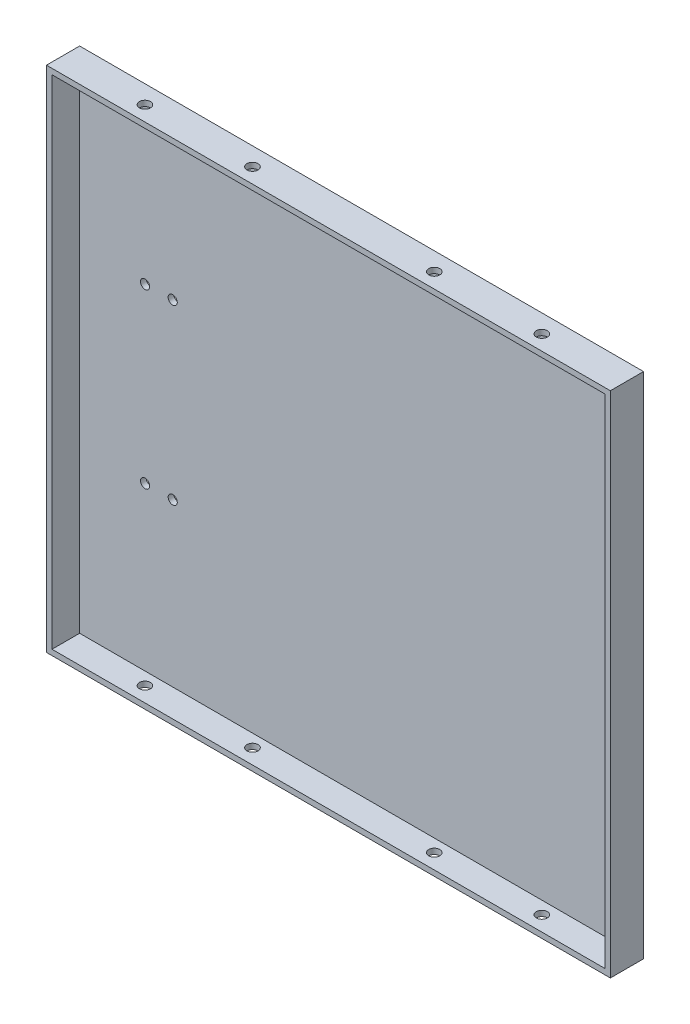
ISO-10303-21;
HEADER;
FILE_DESCRIPTION(('STEP AP214'),'2;1');
FILE_NAME('part.step','',(''),(''),'','','');
FILE_SCHEMA(('AUTOMOTIVE_DESIGN { 1 0 10303 214 1 1 1 1 }'));
ENDSEC;
DATA;
#1=APPLICATION_CONTEXT('core data for automotive mechanical design processes');
#2=APPLICATION_PROTOCOL_DEFINITION('international standard','automotive_design',2000,#1);
#3=PRODUCT_CONTEXT('',#1,'mechanical');
#4=PRODUCT('Part','Part','',(#3));
#5=PRODUCT_RELATED_PRODUCT_CATEGORY('part','',(#4));
#6=PRODUCT_DEFINITION_FORMATION('','',#4);
#7=PRODUCT_DEFINITION_CONTEXT('part definition',#1,'design');
#8=PRODUCT_DEFINITION('design','',#6,#7);
#9=PRODUCT_DEFINITION_SHAPE('','',#8);
#10=(LENGTH_UNIT() NAMED_UNIT(*) SI_UNIT(.MILLI.,.METRE.));
#11=(NAMED_UNIT(*) PLANE_ANGLE_UNIT() SI_UNIT($,.RADIAN.));
#12=(NAMED_UNIT(*) SI_UNIT($,.STERADIAN.) SOLID_ANGLE_UNIT());
#13=UNCERTAINTY_MEASURE_WITH_UNIT(LENGTH_MEASURE(1.E-05),#10,'distance_accuracy_value','');
#14=(GEOMETRIC_REPRESENTATION_CONTEXT(3) GLOBAL_UNCERTAINTY_ASSIGNED_CONTEXT((#13)) GLOBAL_UNIT_ASSIGNED_CONTEXT((#10,
#11,#12)) REPRESENTATION_CONTEXT('',''));
#15=CARTESIAN_POINT('',(0.,0.,0.));
#16=DIRECTION('',(0.,0.,1.));
#17=DIRECTION('',(1.,0.,0.));
#18=AXIS2_PLACEMENT_3D('',#15,#16,#17);
#19=CARTESIAN_POINT('',(102.,92.,12.));
#20=DIRECTION('',(-1.,0.,0.));
#21=DIRECTION('',(0.,-1.,0.));
#22=AXIS2_PLACEMENT_3D('',#19,#20,#21);
#23=PLANE('',#22);
#24=DIRECTION('',(0.,1.,0.));
#25=VECTOR('',#24,1.);
#26=CARTESIAN_POINT('',(102.,92.,0.));
#27=LINE('',#26,#25);
#28=CARTESIAN_POINT('',(102.,-92.,0.));
#29=VERTEX_POINT('',#28);
#30=CARTESIAN_POINT('',(102.,92.,0.));
#31=VERTEX_POINT('',#30);
#32=EDGE_CURVE('E159',#29,#31,#27,.T.);
#33=ORIENTED_EDGE('',*,*,#32,.T.);
#34=DIRECTION('',(0.,0.,-1.));
#35=VECTOR('',#34,1.);
#36=CARTESIAN_POINT('',(102.,92.,12.));
#37=LINE('',#36,#35);
#38=CARTESIAN_POINT('',(102.,92.,12.));
#39=VERTEX_POINT('',#38);
#40=EDGE_CURVE('E11',#39,#31,#37,.T.);
#41=ORIENTED_EDGE('',*,*,#40,.F.);
#42=DIRECTION('',(0.,1.,0.));
#43=VECTOR('',#42,1.);
#44=CARTESIAN_POINT('',(102.,92.,12.));
#45=LINE('',#44,#43);
#46=CARTESIAN_POINT('',(102.,-92.,12.));
#47=VERTEX_POINT('',#46);
#48=EDGE_CURVE('E163',#47,#39,#45,.T.);
#49=ORIENTED_EDGE('',*,*,#48,.F.);
#50=DIRECTION('',(0.,0.,-1.));
#51=VECTOR('',#50,1.);
#52=CARTESIAN_POINT('',(102.,-92.,12.));
#53=LINE('',#52,#51);
#54=EDGE_CURVE('E169',#47,#29,#53,.T.);
#55=ORIENTED_EDGE('',*,*,#54,.T.);
#56=EDGE_LOOP('',(#33,#41,#49,#55));
#57=FACE_BOUND('',#56,.T.);
#58=ADVANCED_FACE('F45',(#57),#23,.F.);
#59=CARTESIAN_POINT('',(-102.,92.,12.));
#60=DIRECTION('',(0.,-1.,0.));
#61=DIRECTION('',(0.,0.,-1.));
#62=AXIS2_PLACEMENT_3D('',#59,#60,#61);
#63=PLANE('',#62);
#64=CARTESIAN_POINT('',(-71.7934583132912,92.,6.5844248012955));
#65=DIRECTION('',(0.,-1.,0.));
#66=DIRECTION('',(0.,0.,-1.));
#67=AXIS2_PLACEMENT_3D('',#64,#65,#66);
#68=CIRCLE('',#67,2.);
#69=CARTESIAN_POINT('',(-71.7934583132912,92.,4.5844248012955));
#70=VERTEX_POINT('',#69);
#71=EDGE_CURVE('E198',#70,#70,#68,.T.);
#72=ORIENTED_EDGE('',*,*,#71,.T.);
#73=EDGE_LOOP('',(#72));
#74=FACE_BOUND('',#73,.T.);
#75=CARTESIAN_POINT('',(-32.8831890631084,92.,6.5844248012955));
#76=DIRECTION('',(0.,-1.,0.));
#77=DIRECTION('',(0.,0.,-1.));
#78=AXIS2_PLACEMENT_3D('',#75,#76,#77);
#79=CIRCLE('',#78,2.);
#80=CARTESIAN_POINT('',(-32.8831890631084,92.,4.5844248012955));
#81=VERTEX_POINT('',#80);
#82=EDGE_CURVE('E227',#81,#81,#79,.T.);
#83=ORIENTED_EDGE('',*,*,#82,.T.);
#84=EDGE_LOOP('',(#83));
#85=FACE_BOUND('',#84,.T.);
#86=CARTESIAN_POINT('',(32.8831890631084,92.,6.5844248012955));
#87=DIRECTION('',(0.,-1.,0.));
#88=DIRECTION('',(0.,0.,1.));
#89=AXIS2_PLACEMENT_3D('',#86,#87,#88);
#90=CIRCLE('',#89,2.);
#91=CARTESIAN_POINT('',(32.8831890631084,92.,8.58442480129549));
#92=VERTEX_POINT('',#91);
#93=EDGE_CURVE('E222',#92,#92,#90,.T.);
#94=ORIENTED_EDGE('',*,*,#93,.T.);
#95=EDGE_LOOP('',(#94));
#96=FACE_BOUND('',#95,.T.);
#97=CARTESIAN_POINT('',(71.7934583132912,92.,6.5844248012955));
#98=DIRECTION('',(0.,-1.,0.));
#99=DIRECTION('',(0.,0.,1.));
#100=AXIS2_PLACEMENT_3D('',#97,#98,#99);
#101=CIRCLE('',#100,2.);
#102=CARTESIAN_POINT('',(71.7934583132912,92.,8.58442480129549));
#103=VERTEX_POINT('',#102);
#104=EDGE_CURVE('E218',#103,#103,#101,.T.);
#105=ORIENTED_EDGE('',*,*,#104,.T.);
#106=EDGE_LOOP('',(#105));
#107=FACE_BOUND('',#106,.T.);
#108=DIRECTION('',(-1.,0.,0.));
#109=VECTOR('',#108,1.);
#110=CARTESIAN_POINT('',(-102.,92.,0.));
#111=LINE('',#110,#109);
#112=CARTESIAN_POINT('',(-102.,92.,0.));
#113=VERTEX_POINT('',#112);
#114=EDGE_CURVE('E172',#31,#113,#111,.T.);
#115=ORIENTED_EDGE('',*,*,#114,.T.);
#116=DIRECTION('',(0.,0.,-1.));
#117=VECTOR('',#116,1.);
#118=CARTESIAN_POINT('',(-102.,92.,12.));
#119=LINE('',#118,#117);
#120=CARTESIAN_POINT('',(-102.,92.,12.));
#121=VERTEX_POINT('',#120);
#122=EDGE_CURVE('E53',#121,#113,#119,.T.);
#123=ORIENTED_EDGE('',*,*,#122,.F.);
#124=DIRECTION('',(-1.,0.,0.));
#125=VECTOR('',#124,1.);
#126=CARTESIAN_POINT('',(-102.,92.,12.));
#127=LINE('',#126,#125);
#128=EDGE_CURVE('E98',#39,#121,#127,.T.);
#129=ORIENTED_EDGE('',*,*,#128,.F.);
#130=ORIENTED_EDGE('',*,*,#40,.T.);
#131=EDGE_LOOP('',(#115,#123,#129,#130));
#132=FACE_BOUND('',#131,.T.);
#133=ADVANCED_FACE('F260',(#74,#85,#96,#107,#132),#63,.F.);
#134=CARTESIAN_POINT('',(-102.,92.,12.));
#135=DIRECTION('',(1.,0.,0.));
#136=DIRECTION('',(0.,1.,0.));
#137=AXIS2_PLACEMENT_3D('',#134,#135,#136);
#138=PLANE('',#137);
#139=DIRECTION('',(0.,-1.,0.));
#140=VECTOR('',#139,1.);
#141=CARTESIAN_POINT('',(-102.,92.,0.));
#142=LINE('',#141,#140);
#143=CARTESIAN_POINT('',(-102.,-92.,0.));
#144=VERTEX_POINT('',#143);
#145=EDGE_CURVE('E174',#113,#144,#142,.T.);
#146=ORIENTED_EDGE('',*,*,#145,.T.);
#147=DIRECTION('',(0.,0.,-1.));
#148=VECTOR('',#147,1.);
#149=CARTESIAN_POINT('',(-102.,-92.,12.));
#150=LINE('',#149,#148);
#151=CARTESIAN_POINT('',(-102.,-92.,12.));
#152=VERTEX_POINT('',#151);
#153=EDGE_CURVE('E178',#152,#144,#150,.T.);
#154=ORIENTED_EDGE('',*,*,#153,.F.);
#155=DIRECTION('',(0.,-1.,0.));
#156=VECTOR('',#155,1.);
#157=CARTESIAN_POINT('',(-102.,92.,12.));
#158=LINE('',#157,#156);
#159=EDGE_CURVE('E166',#121,#152,#158,.T.);
#160=ORIENTED_EDGE('',*,*,#159,.F.);
#161=ORIENTED_EDGE('',*,*,#122,.T.);
#162=EDGE_LOOP('',(#146,#154,#160,#161));
#163=FACE_BOUND('',#162,.T.);
#164=ADVANCED_FACE('F248',(#163),#138,.F.);
#165=CARTESIAN_POINT('',(-102.,-92.,12.));
#166=DIRECTION('',(0.,1.,0.));
#167=DIRECTION('',(0.,0.,1.));
#168=AXIS2_PLACEMENT_3D('',#165,#166,#167);
#169=PLANE('',#168);
#170=CARTESIAN_POINT('',(-71.7934583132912,-92.,6.5844248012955));
#171=DIRECTION('',(0.,-1.,0.));
#172=DIRECTION('',(0.,0.,-1.));
#173=AXIS2_PLACEMENT_3D('',#170,#171,#172);
#174=CIRCLE('',#173,2.);
#175=CARTESIAN_POINT('',(-71.7934583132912,-92.,4.5844248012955));
#176=VERTEX_POINT('',#175);
#177=EDGE_CURVE('E186',#176,#176,#174,.T.);
#178=ORIENTED_EDGE('',*,*,#177,.F.);
#179=EDGE_LOOP('',(#178));
#180=FACE_BOUND('',#179,.T.);
#181=CARTESIAN_POINT('',(-32.8831890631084,-92.,6.5844248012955));
#182=DIRECTION('',(0.,-1.,0.));
#183=DIRECTION('',(0.,0.,-1.));
#184=AXIS2_PLACEMENT_3D('',#181,#182,#183);
#185=CIRCLE('',#184,2.);
#186=CARTESIAN_POINT('',(-32.8831890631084,-92.,4.5844248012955));
#187=VERTEX_POINT('',#186);
#188=EDGE_CURVE('E233',#187,#187,#185,.T.);
#189=ORIENTED_EDGE('',*,*,#188,.F.);
#190=EDGE_LOOP('',(#189));
#191=FACE_BOUND('',#190,.T.);
#192=CARTESIAN_POINT('',(32.8831890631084,-92.,6.5844248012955));
#193=DIRECTION('',(0.,-1.,0.));
#194=DIRECTION('',(0.,0.,1.));
#195=AXIS2_PLACEMENT_3D('',#192,#193,#194);
#196=CIRCLE('',#195,2.);
#197=CARTESIAN_POINT('',(32.8831890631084,-92.,8.58442480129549));
#198=VERTEX_POINT('',#197);
#199=EDGE_CURVE('E235',#198,#198,#196,.T.);
#200=ORIENTED_EDGE('',*,*,#199,.F.);
#201=EDGE_LOOP('',(#200));
#202=FACE_BOUND('',#201,.T.);
#203=CARTESIAN_POINT('',(71.7934583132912,-92.,6.5844248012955));
#204=DIRECTION('',(0.,-1.,0.));
#205=DIRECTION('',(0.,0.,1.));
#206=AXIS2_PLACEMENT_3D('',#203,#204,#205);
#207=CIRCLE('',#206,2.);
#208=CARTESIAN_POINT('',(71.7934583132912,-92.,8.58442480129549));
#209=VERTEX_POINT('',#208);
#210=EDGE_CURVE('E146',#209,#209,#207,.T.);
#211=ORIENTED_EDGE('',*,*,#210,.F.);
#212=EDGE_LOOP('',(#211));
#213=FACE_BOUND('',#212,.T.);
#214=DIRECTION('',(1.,0.,0.));
#215=VECTOR('',#214,1.);
#216=CARTESIAN_POINT('',(-102.,-92.,0.));
#217=LINE('',#216,#215);
#218=EDGE_CURVE('E91',#144,#29,#217,.T.);
#219=ORIENTED_EDGE('',*,*,#218,.T.);
#220=ORIENTED_EDGE('',*,*,#54,.F.);
#221=DIRECTION('',(1.,0.,0.));
#222=VECTOR('',#221,1.);
#223=CARTESIAN_POINT('',(-102.,-92.,12.));
#224=LINE('',#223,#222);
#225=EDGE_CURVE('E70',#152,#47,#224,.T.);
#226=ORIENTED_EDGE('',*,*,#225,.F.);
#227=ORIENTED_EDGE('',*,*,#153,.T.);
#228=EDGE_LOOP('',(#219,#220,#226,#227));
#229=FACE_BOUND('',#228,.T.);
#230=ADVANCED_FACE('F245',(#180,#191,#202,#213,#229),#169,.F.);
#231=CARTESIAN_POINT('',(0.,0.,12.));
#232=DIRECTION('',(0.,0.,1.));
#233=DIRECTION('',(1.,0.,0.));
#234=AXIS2_PLACEMENT_3D('',#231,#232,#233);
#235=PLANE('',#234);
#236=DIRECTION('',(1.,0.,0.));
#237=VECTOR('',#236,1.);
#238=CARTESIAN_POINT('',(-100.,-90.,12.));
#239=LINE('',#238,#237);
#240=CARTESIAN_POINT('',(-100.,-90.,12.));
#241=VERTEX_POINT('',#240);
#242=CARTESIAN_POINT('',(100.,-90.,12.));
#243=VERTEX_POINT('',#242);
#244=EDGE_CURVE('E61',#241,#243,#239,.T.);
#245=ORIENTED_EDGE('',*,*,#244,.F.);
#246=DIRECTION('',(0.,-1.,0.));
#247=VECTOR('',#246,1.);
#248=CARTESIAN_POINT('',(-100.,90.,12.));
#249=LINE('',#248,#247);
#250=CARTESIAN_POINT('',(-100.,90.,12.));
#251=VERTEX_POINT('',#250);
#252=EDGE_CURVE('E140',#251,#241,#249,.T.);
#253=ORIENTED_EDGE('',*,*,#252,.F.);
#254=DIRECTION('',(1.,0.,0.));
#255=VECTOR('',#254,1.);
#256=CARTESIAN_POINT('',(-100.,90.,12.));
#257=LINE('',#256,#255);
#258=CARTESIAN_POINT('',(100.,90.,12.));
#259=VERTEX_POINT('',#258);
#260=EDGE_CURVE('E143',#251,#259,#257,.T.);
#261=ORIENTED_EDGE('',*,*,#260,.T.);
#262=DIRECTION('',(0.,-1.,0.));
#263=VECTOR('',#262,1.);
#264=CARTESIAN_POINT('',(100.,90.,12.));
#265=LINE('',#264,#263);
#266=EDGE_CURVE('E152',#259,#243,#265,.T.);
#267=ORIENTED_EDGE('',*,*,#266,.T.);
#268=EDGE_LOOP('',(#245,#253,#261,#267));
#269=FACE_BOUND('',#268,.T.);
#270=ORIENTED_EDGE('',*,*,#48,.T.);
#271=ORIENTED_EDGE('',*,*,#128,.T.);
#272=ORIENTED_EDGE('',*,*,#159,.T.);
#273=ORIENTED_EDGE('',*,*,#225,.T.);
#274=EDGE_LOOP('',(#270,#271,#272,#273));
#275=FACE_BOUND('',#274,.T.);
#276=ADVANCED_FACE('F247',(#269,#275),#235,.T.);
#277=CARTESIAN_POINT('',(0.,0.,0.));
#278=DIRECTION('',(0.,0.,1.));
#279=DIRECTION('',(1.,0.,0.));
#280=AXIS2_PLACEMENT_3D('',#277,#278,#279);
#281=PLANE('',#280);
#282=CARTESIAN_POINT('',(-66.3286348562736,-31.2999950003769,0.));
#283=DIRECTION('',(0.,0.,-1.));
#284=DIRECTION('',(-1.,0.,0.));
#285=AXIS2_PLACEMENT_3D('',#282,#283,#284);
#286=CIRCLE('',#285,1.65);
#287=CARTESIAN_POINT('',(-67.9786348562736,-31.2999950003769,0.));
#288=VERTEX_POINT('',#287);
#289=EDGE_CURVE('E358',#288,#288,#286,.T.);
#290=ORIENTED_EDGE('',*,*,#289,.F.);
#291=EDGE_LOOP('',(#290));
#292=FACE_BOUND('',#291,.T.);
#293=CARTESIAN_POINT('',(-76.328134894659,31.1999999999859,0.));
#294=DIRECTION('',(0.,0.,-1.));
#295=DIRECTION('',(-1.,0.,0.));
#296=AXIS2_PLACEMENT_3D('',#293,#294,#295);
#297=CIRCLE('',#296,1.64999999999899);
#298=CARTESIAN_POINT('',(-77.978134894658,31.1999999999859,0.));
#299=VERTEX_POINT('',#298);
#300=EDGE_CURVE('E355',#299,#299,#297,.T.);
#301=ORIENTED_EDGE('',*,*,#300,.F.);
#302=EDGE_LOOP('',(#301));
#303=FACE_BOUND('',#302,.T.);
#304=CARTESIAN_POINT('',(-66.3286348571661,31.2999950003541,0.));
#305=DIRECTION('',(0.,0.,-1.));
#306=DIRECTION('',(-1.,0.,0.));
#307=AXIS2_PLACEMENT_3D('',#304,#305,#306);
#308=CIRCLE('',#307,1.64999999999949);
#309=CARTESIAN_POINT('',(-67.9786348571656,31.2999950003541,0.));
#310=VERTEX_POINT('',#309);
#311=EDGE_CURVE('E348',#310,#310,#308,.T.);
#312=ORIENTED_EDGE('',*,*,#311,.F.);
#313=EDGE_LOOP('',(#312));
#314=FACE_BOUND('',#313,.T.);
#315=CARTESIAN_POINT('',(-76.3281348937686,-31.2000000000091,0.));
#316=DIRECTION('',(0.,0.,-1.));
#317=DIRECTION('',(-1.,0.,0.));
#318=AXIS2_PLACEMENT_3D('',#315,#316,#317);
#319=CIRCLE('',#318,1.65);
#320=CARTESIAN_POINT('',(-77.9781348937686,-31.2000000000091,0.));
#321=VERTEX_POINT('',#320);
#322=EDGE_CURVE('E211',#321,#321,#319,.T.);
#323=ORIENTED_EDGE('',*,*,#322,.F.);
#324=EDGE_LOOP('',(#323));
#325=FACE_BOUND('',#324,.T.);
#326=ORIENTED_EDGE('',*,*,#32,.F.);
#327=ORIENTED_EDGE('',*,*,#218,.F.);
#328=ORIENTED_EDGE('',*,*,#145,.F.);
#329=ORIENTED_EDGE('',*,*,#114,.F.);
#330=EDGE_LOOP('',(#326,#327,#328,#329));
#331=FACE_BOUND('',#330,.T.);
#332=ADVANCED_FACE('F256',(#292,#303,#314,#325,#331),#281,.F.);
#333=CARTESIAN_POINT('',(-100.,-90.,2.));
#334=DIRECTION('',(0.,-1.,0.));
#335=DIRECTION('',(0.,0.,-1.));
#336=AXIS2_PLACEMENT_3D('',#333,#334,#335);
#337=PLANE('',#336);
#338=CARTESIAN_POINT('',(-71.7934583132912,-90.,6.5844248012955));
#339=DIRECTION('',(0.,-1.,0.));
#340=DIRECTION('',(0.,0.,-1.));
#341=AXIS2_PLACEMENT_3D('',#338,#339,#340);
#342=CIRCLE('',#341,2.);
#343=CARTESIAN_POINT('',(-71.7934583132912,-90.,4.5844248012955));
#344=VERTEX_POINT('',#343);
#345=EDGE_CURVE('E153',#344,#344,#342,.T.);
#346=ORIENTED_EDGE('',*,*,#345,.T.);
#347=EDGE_LOOP('',(#346));
#348=FACE_BOUND('',#347,.T.);
#349=CARTESIAN_POINT('',(-32.8831890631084,-90.,6.5844248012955));
#350=DIRECTION('',(0.,-1.,0.));
#351=DIRECTION('',(0.,0.,-1.));
#352=AXIS2_PLACEMENT_3D('',#349,#350,#351);
#353=CIRCLE('',#352,2.);
#354=CARTESIAN_POINT('',(-32.8831890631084,-90.,4.5844248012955));
#355=VERTEX_POINT('',#354);
#356=EDGE_CURVE('E189',#355,#355,#353,.T.);
#357=ORIENTED_EDGE('',*,*,#356,.T.);
#358=EDGE_LOOP('',(#357));
#359=FACE_BOUND('',#358,.T.);
#360=CARTESIAN_POINT('',(32.8831890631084,-90.,6.5844248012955));
#361=DIRECTION('',(0.,-1.,0.));
#362=DIRECTION('',(0.,0.,-1.));
#363=AXIS2_PLACEMENT_3D('',#360,#361,#362);
#364=CIRCLE('',#363,2.);
#365=CARTESIAN_POINT('',(32.8831890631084,-90.,4.5844248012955));
#366=VERTEX_POINT('',#365);
#367=EDGE_CURVE('E185',#366,#366,#364,.T.);
#368=ORIENTED_EDGE('',*,*,#367,.T.);
#369=EDGE_LOOP('',(#368));
#370=FACE_BOUND('',#369,.T.);
#371=CARTESIAN_POINT('',(71.7934583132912,-90.,6.5844248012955));
#372=DIRECTION('',(0.,-1.,0.));
#373=DIRECTION('',(0.,0.,-1.));
#374=AXIS2_PLACEMENT_3D('',#371,#372,#373);
#375=CIRCLE('',#374,2.);
#376=CARTESIAN_POINT('',(71.7934583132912,-90.,4.5844248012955));
#377=VERTEX_POINT('',#376);
#378=EDGE_CURVE('E182',#377,#377,#375,.T.);
#379=ORIENTED_EDGE('',*,*,#378,.T.);
#380=EDGE_LOOP('',(#379));
#381=FACE_BOUND('',#380,.T.);
#382=ORIENTED_EDGE('',*,*,#244,.T.);
#383=DIRECTION('',(0.,0.,1.));
#384=VECTOR('',#383,1.);
#385=CARTESIAN_POINT('',(100.,-90.,2.));
#386=LINE('',#385,#384);
#387=CARTESIAN_POINT('',(100.,-90.,2.));
#388=VERTEX_POINT('',#387);
#389=EDGE_CURVE('E124',#388,#243,#386,.T.);
#390=ORIENTED_EDGE('',*,*,#389,.F.);
#391=DIRECTION('',(1.,0.,0.));
#392=VECTOR('',#391,1.);
#393=CARTESIAN_POINT('',(-100.,-90.,2.));
#394=LINE('',#393,#392);
#395=CARTESIAN_POINT('',(-100.,-90.,2.));
#396=VERTEX_POINT('',#395);
#397=EDGE_CURVE('E131',#396,#388,#394,.T.);
#398=ORIENTED_EDGE('',*,*,#397,.F.);
#399=DIRECTION('',(0.,0.,1.));
#400=VECTOR('',#399,1.);
#401=CARTESIAN_POINT('',(-100.,-90.,2.));
#402=LINE('',#401,#400);
#403=EDGE_CURVE('E157',#396,#241,#402,.T.);
#404=ORIENTED_EDGE('',*,*,#403,.T.);
#405=EDGE_LOOP('',(#382,#390,#398,#404));
#406=FACE_BOUND('',#405,.T.);
#407=ADVANCED_FACE('F134',(#348,#359,#370,#381,#406),#337,.F.);
#408=CARTESIAN_POINT('',(-100.,90.,2.));
#409=DIRECTION('',(-1.,0.,0.));
#410=DIRECTION('',(0.,-1.,0.));
#411=AXIS2_PLACEMENT_3D('',#408,#409,#410);
#412=PLANE('',#411);
#413=ORIENTED_EDGE('',*,*,#252,.T.);
#414=ORIENTED_EDGE('',*,*,#403,.F.);
#415=DIRECTION('',(0.,-1.,0.));
#416=VECTOR('',#415,1.);
#417=CARTESIAN_POINT('',(-100.,90.,2.));
#418=LINE('',#417,#416);
#419=CARTESIAN_POINT('',(-100.,90.,2.));
#420=VERTEX_POINT('',#419);
#421=EDGE_CURVE('E136',#420,#396,#418,.T.);
#422=ORIENTED_EDGE('',*,*,#421,.F.);
#423=DIRECTION('',(0.,0.,1.));
#424=VECTOR('',#423,1.);
#425=CARTESIAN_POINT('',(-100.,90.,2.));
#426=LINE('',#425,#424);
#427=EDGE_CURVE('E160',#420,#251,#426,.T.);
#428=ORIENTED_EDGE('',*,*,#427,.T.);
#429=EDGE_LOOP('',(#413,#414,#422,#428));
#430=FACE_BOUND('',#429,.T.);
#431=ADVANCED_FACE('F285',(#430),#412,.F.);
#432=CARTESIAN_POINT('',(-100.,90.,2.));
#433=DIRECTION('',(0.,-1.,0.));
#434=DIRECTION('',(0.,0.,-1.));
#435=AXIS2_PLACEMENT_3D('',#432,#433,#434);
#436=PLANE('',#435);
#437=CARTESIAN_POINT('',(-71.7934583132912,90.,6.5844248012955));
#438=DIRECTION('',(0.,-1.,0.));
#439=DIRECTION('',(0.,0.,-1.));
#440=AXIS2_PLACEMENT_3D('',#437,#438,#439);
#441=CIRCLE('',#440,2.);
#442=CARTESIAN_POINT('',(-71.7934583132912,90.,4.5844248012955));
#443=VERTEX_POINT('',#442);
#444=EDGE_CURVE('E204',#443,#443,#441,.F.);
#445=ORIENTED_EDGE('',*,*,#444,.T.);
#446=EDGE_LOOP('',(#445));
#447=FACE_BOUND('',#446,.T.);
#448=CARTESIAN_POINT('',(-32.8831890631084,90.,6.5844248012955));
#449=DIRECTION('',(0.,-1.,0.));
#450=DIRECTION('',(0.,0.,-1.));
#451=AXIS2_PLACEMENT_3D('',#448,#449,#450);
#452=CIRCLE('',#451,2.);
#453=CARTESIAN_POINT('',(-32.8831890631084,90.,4.5844248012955));
#454=VERTEX_POINT('',#453);
#455=EDGE_CURVE('E201',#454,#454,#452,.F.);
#456=ORIENTED_EDGE('',*,*,#455,.T.);
#457=EDGE_LOOP('',(#456));
#458=FACE_BOUND('',#457,.T.);
#459=CARTESIAN_POINT('',(32.8831890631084,90.,6.5844248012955));
#460=DIRECTION('',(0.,-1.,0.));
#461=DIRECTION('',(0.,0.,-1.));
#462=AXIS2_PLACEMENT_3D('',#459,#460,#461);
#463=CIRCLE('',#462,2.);
#464=CARTESIAN_POINT('',(32.8831890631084,90.,4.5844248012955));
#465=VERTEX_POINT('',#464);
#466=EDGE_CURVE('E197',#465,#465,#463,.F.);
#467=ORIENTED_EDGE('',*,*,#466,.T.);
#468=EDGE_LOOP('',(#467));
#469=FACE_BOUND('',#468,.T.);
#470=CARTESIAN_POINT('',(71.7934583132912,90.,6.5844248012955));
#471=DIRECTION('',(0.,-1.,0.));
#472=DIRECTION('',(0.,0.,-1.));
#473=AXIS2_PLACEMENT_3D('',#470,#471,#472);
#474=CIRCLE('',#473,2.);
#475=CARTESIAN_POINT('',(71.7934583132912,90.,4.5844248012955));
#476=VERTEX_POINT('',#475);
#477=EDGE_CURVE('E194',#476,#476,#474,.F.);
#478=ORIENTED_EDGE('',*,*,#477,.T.);
#479=EDGE_LOOP('',(#478));
#480=FACE_BOUND('',#479,.T.);
#481=ORIENTED_EDGE('',*,*,#260,.F.);
#482=ORIENTED_EDGE('',*,*,#427,.F.);
#483=DIRECTION('',(1.,0.,0.));
#484=VECTOR('',#483,1.);
#485=CARTESIAN_POINT('',(-100.,90.,2.));
#486=LINE('',#485,#484);
#487=CARTESIAN_POINT('',(100.,90.,2.));
#488=VERTEX_POINT('',#487);
#489=EDGE_CURVE('E130',#420,#488,#486,.T.);
#490=ORIENTED_EDGE('',*,*,#489,.T.);
#491=DIRECTION('',(0.,0.,1.));
#492=VECTOR('',#491,1.);
#493=CARTESIAN_POINT('',(100.,90.,2.));
#494=LINE('',#493,#492);
#495=EDGE_CURVE('E126',#488,#259,#494,.T.);
#496=ORIENTED_EDGE('',*,*,#495,.T.);
#497=EDGE_LOOP('',(#481,#482,#490,#496));
#498=FACE_BOUND('',#497,.T.);
#499=ADVANCED_FACE('F292',(#447,#458,#469,#480,#498),#436,.T.);
#500=CARTESIAN_POINT('',(100.,90.,2.));
#501=DIRECTION('',(-1.,0.,0.));
#502=DIRECTION('',(0.,-1.,0.));
#503=AXIS2_PLACEMENT_3D('',#500,#501,#502);
#504=PLANE('',#503);
#505=ORIENTED_EDGE('',*,*,#266,.F.);
#506=ORIENTED_EDGE('',*,*,#495,.F.);
#507=DIRECTION('',(0.,-1.,0.));
#508=VECTOR('',#507,1.);
#509=CARTESIAN_POINT('',(100.,90.,2.));
#510=LINE('',#509,#508);
#511=EDGE_CURVE('E121',#488,#388,#510,.T.);
#512=ORIENTED_EDGE('',*,*,#511,.T.);
#513=ORIENTED_EDGE('',*,*,#389,.T.);
#514=EDGE_LOOP('',(#505,#506,#512,#513));
#515=FACE_BOUND('',#514,.T.);
#516=ADVANCED_FACE('F123',(#515),#504,.T.);
#517=CARTESIAN_POINT('',(0.,0.,2.));
#518=DIRECTION('',(0.,0.,-1.));
#519=DIRECTION('',(-1.,0.,0.));
#520=AXIS2_PLACEMENT_3D('',#517,#518,#519);
#521=PLANE('',#520);
#522=CARTESIAN_POINT('',(-66.3286348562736,-31.2999950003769,2.));
#523=DIRECTION('',(0.,0.,-1.));
#524=DIRECTION('',(-1.,0.,0.));
#525=AXIS2_PLACEMENT_3D('',#522,#523,#524);
#526=CIRCLE('',#525,1.65);
#527=CARTESIAN_POINT('',(-67.9786348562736,-31.2999950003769,2.));
#528=VERTEX_POINT('',#527);
#529=EDGE_CURVE('E48',#528,#528,#526,.T.);
#530=ORIENTED_EDGE('',*,*,#529,.T.);
#531=EDGE_LOOP('',(#530));
#532=FACE_BOUND('',#531,.T.);
#533=CARTESIAN_POINT('',(-76.328134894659,31.1999999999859,2.));
#534=DIRECTION('',(0.,0.,-1.));
#535=DIRECTION('',(-1.,0.,0.));
#536=AXIS2_PLACEMENT_3D('',#533,#534,#535);
#537=CIRCLE('',#536,1.64999999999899);
#538=CARTESIAN_POINT('',(-77.978134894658,31.1999999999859,2.));
#539=VERTEX_POINT('',#538);
#540=EDGE_CURVE('E213',#539,#539,#537,.T.);
#541=ORIENTED_EDGE('',*,*,#540,.T.);
#542=EDGE_LOOP('',(#541));
#543=FACE_BOUND('',#542,.T.);
#544=CARTESIAN_POINT('',(-66.3286348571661,31.2999950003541,2.));
#545=DIRECTION('',(0.,0.,-1.));
#546=DIRECTION('',(-1.,0.,0.));
#547=AXIS2_PLACEMENT_3D('',#544,#545,#546);
#548=CIRCLE('',#547,1.64999999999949);
#549=CARTESIAN_POINT('',(-67.9786348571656,31.2999950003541,2.));
#550=VERTEX_POINT('',#549);
#551=EDGE_CURVE('E210',#550,#550,#548,.T.);
#552=ORIENTED_EDGE('',*,*,#551,.T.);
#553=EDGE_LOOP('',(#552));
#554=FACE_BOUND('',#553,.T.);
#555=CARTESIAN_POINT('',(-76.3281348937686,-31.2000000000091,2.));
#556=DIRECTION('',(0.,0.,-1.));
#557=DIRECTION('',(-1.,0.,0.));
#558=AXIS2_PLACEMENT_3D('',#555,#556,#557);
#559=CIRCLE('',#558,1.65);
#560=CARTESIAN_POINT('',(-77.9781348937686,-31.2000000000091,2.));
#561=VERTEX_POINT('',#560);
#562=EDGE_CURVE('E207',#561,#561,#559,.T.);
#563=ORIENTED_EDGE('',*,*,#562,.T.);
#564=EDGE_LOOP('',(#563));
#565=FACE_BOUND('',#564,.T.);
#566=ORIENTED_EDGE('',*,*,#397,.T.);
#567=ORIENTED_EDGE('',*,*,#511,.F.);
#568=ORIENTED_EDGE('',*,*,#489,.F.);
#569=ORIENTED_EDGE('',*,*,#421,.T.);
#570=EDGE_LOOP('',(#566,#567,#568,#569));
#571=FACE_BOUND('',#570,.T.);
#572=ADVANCED_FACE('F138',(#532,#543,#554,#565,#571),#521,.F.);
#573=CARTESIAN_POINT('',(71.7934583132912,-82.,6.5844248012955));
#574=DIRECTION('',(0.,-1.,0.));
#575=DIRECTION('',(0.,0.,-1.));
#576=AXIS2_PLACEMENT_3D('',#573,#574,#575);
#577=CYLINDRICAL_SURFACE('',#576,2.);
#578=ORIENTED_EDGE('',*,*,#210,.T.);
#579=EDGE_LOOP('',(#578));
#580=FACE_BOUND('',#579,.T.);
#581=ORIENTED_EDGE('',*,*,#378,.F.);
#582=EDGE_LOOP('',(#581));
#583=FACE_BOUND('',#582,.T.);
#584=ADVANCED_FACE('F242',(#580,#583),#577,.F.);
#585=CARTESIAN_POINT('',(32.8831890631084,-82.,6.5844248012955));
#586=DIRECTION('',(0.,-1.,0.));
#587=DIRECTION('',(0.,0.,-1.));
#588=AXIS2_PLACEMENT_3D('',#585,#586,#587);
#589=CYLINDRICAL_SURFACE('',#588,2.);
#590=ORIENTED_EDGE('',*,*,#199,.T.);
#591=EDGE_LOOP('',(#590));
#592=FACE_BOUND('',#591,.T.);
#593=ORIENTED_EDGE('',*,*,#367,.F.);
#594=EDGE_LOOP('',(#593));
#595=FACE_BOUND('',#594,.T.);
#596=ADVANCED_FACE('F302',(#592,#595),#589,.F.);
#597=CARTESIAN_POINT('',(-32.8831890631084,-82.,6.5844248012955));
#598=DIRECTION('',(0.,-1.,0.));
#599=DIRECTION('',(0.,0.,-1.));
#600=AXIS2_PLACEMENT_3D('',#597,#598,#599);
#601=CYLINDRICAL_SURFACE('',#600,2.);
#602=ORIENTED_EDGE('',*,*,#188,.T.);
#603=EDGE_LOOP('',(#602));
#604=FACE_BOUND('',#603,.T.);
#605=ORIENTED_EDGE('',*,*,#356,.F.);
#606=EDGE_LOOP('',(#605));
#607=FACE_BOUND('',#606,.T.);
#608=ADVANCED_FACE('F305',(#604,#607),#601,.F.);
#609=CARTESIAN_POINT('',(-71.7934583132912,-82.,6.5844248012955));
#610=DIRECTION('',(0.,-1.,0.));
#611=DIRECTION('',(0.,0.,-1.));
#612=AXIS2_PLACEMENT_3D('',#609,#610,#611);
#613=CYLINDRICAL_SURFACE('',#612,2.);
#614=ORIENTED_EDGE('',*,*,#177,.T.);
#615=EDGE_LOOP('',(#614));
#616=FACE_BOUND('',#615,.T.);
#617=ORIENTED_EDGE('',*,*,#345,.F.);
#618=EDGE_LOOP('',(#617));
#619=FACE_BOUND('',#618,.T.);
#620=ADVANCED_FACE('F308',(#616,#619),#613,.F.);
#621=CARTESIAN_POINT('',(71.7934583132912,82.,6.5844248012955));
#622=DIRECTION('',(0.,1.,0.));
#623=DIRECTION('',(0.,0.,1.));
#624=AXIS2_PLACEMENT_3D('',#621,#622,#623);
#625=CYLINDRICAL_SURFACE('',#624,2.);
#626=ORIENTED_EDGE('',*,*,#477,.F.);
#627=EDGE_LOOP('',(#626));
#628=FACE_BOUND('',#627,.T.);
#629=ORIENTED_EDGE('',*,*,#104,.F.);
#630=EDGE_LOOP('',(#629));
#631=FACE_BOUND('',#630,.T.);
#632=ADVANCED_FACE('F312',(#628,#631),#625,.F.);
#633=CARTESIAN_POINT('',(32.8831890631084,82.,6.5844248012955));
#634=DIRECTION('',(0.,1.,0.));
#635=DIRECTION('',(0.,0.,1.));
#636=AXIS2_PLACEMENT_3D('',#633,#634,#635);
#637=CYLINDRICAL_SURFACE('',#636,2.);
#638=ORIENTED_EDGE('',*,*,#466,.F.);
#639=EDGE_LOOP('',(#638));
#640=FACE_BOUND('',#639,.T.);
#641=ORIENTED_EDGE('',*,*,#93,.F.);
#642=EDGE_LOOP('',(#641));
#643=FACE_BOUND('',#642,.T.);
#644=ADVANCED_FACE('F316',(#640,#643),#637,.F.);
#645=CARTESIAN_POINT('',(-32.8831890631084,82.,6.5844248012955));
#646=DIRECTION('',(0.,1.,0.));
#647=DIRECTION('',(0.,0.,1.));
#648=AXIS2_PLACEMENT_3D('',#645,#646,#647);
#649=CYLINDRICAL_SURFACE('',#648,2.);
#650=ORIENTED_EDGE('',*,*,#455,.F.);
#651=EDGE_LOOP('',(#650));
#652=FACE_BOUND('',#651,.T.);
#653=ORIENTED_EDGE('',*,*,#82,.F.);
#654=EDGE_LOOP('',(#653));
#655=FACE_BOUND('',#654,.T.);
#656=ADVANCED_FACE('F320',(#652,#655),#649,.F.);
#657=CARTESIAN_POINT('',(-71.7934583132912,82.,6.5844248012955));
#658=DIRECTION('',(0.,1.,0.));
#659=DIRECTION('',(0.,0.,1.));
#660=AXIS2_PLACEMENT_3D('',#657,#658,#659);
#661=CYLINDRICAL_SURFACE('',#660,2.);
#662=ORIENTED_EDGE('',*,*,#444,.F.);
#663=EDGE_LOOP('',(#662));
#664=FACE_BOUND('',#663,.T.);
#665=ORIENTED_EDGE('',*,*,#71,.F.);
#666=EDGE_LOOP('',(#665));
#667=FACE_BOUND('',#666,.T.);
#668=ADVANCED_FACE('F324',(#664,#667),#661,.F.);
#669=CARTESIAN_POINT('',(-76.3281348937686,-31.2000000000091,20.));
#670=DIRECTION('',(0.,0.,-1.));
#671=DIRECTION('',(-1.,0.,0.));
#672=AXIS2_PLACEMENT_3D('',#669,#670,#671);
#673=CYLINDRICAL_SURFACE('',#672,1.65);
#674=ORIENTED_EDGE('',*,*,#322,.T.);
#675=EDGE_LOOP('',(#674));
#676=FACE_BOUND('',#675,.T.);
#677=ORIENTED_EDGE('',*,*,#562,.F.);
#678=EDGE_LOOP('',(#677));
#679=FACE_BOUND('',#678,.T.);
#680=ADVANCED_FACE('F327',(#676,#679),#673,.F.);
#681=CARTESIAN_POINT('',(-66.3286348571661,31.2999950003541,20.));
#682=DIRECTION('',(0.,0.,-1.));
#683=DIRECTION('',(-1.,0.,0.));
#684=AXIS2_PLACEMENT_3D('',#681,#682,#683);
#685=CYLINDRICAL_SURFACE('',#684,1.64999999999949);
#686=ORIENTED_EDGE('',*,*,#311,.T.);
#687=EDGE_LOOP('',(#686));
#688=FACE_BOUND('',#687,.T.);
#689=ORIENTED_EDGE('',*,*,#551,.F.);
#690=EDGE_LOOP('',(#689));
#691=FACE_BOUND('',#690,.T.);
#692=ADVANCED_FACE('F331',(#688,#691),#685,.F.);
#693=CARTESIAN_POINT('',(-76.328134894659,31.1999999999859,20.));
#694=DIRECTION('',(0.,0.,-1.));
#695=DIRECTION('',(-1.,0.,0.));
#696=AXIS2_PLACEMENT_3D('',#693,#694,#695);
#697=CYLINDRICAL_SURFACE('',#696,1.64999999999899);
#698=ORIENTED_EDGE('',*,*,#300,.T.);
#699=EDGE_LOOP('',(#698));
#700=FACE_BOUND('',#699,.T.);
#701=ORIENTED_EDGE('',*,*,#540,.F.);
#702=EDGE_LOOP('',(#701));
#703=FACE_BOUND('',#702,.T.);
#704=ADVANCED_FACE('F333',(#700,#703),#697,.F.);
#705=CARTESIAN_POINT('',(-66.3286348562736,-31.2999950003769,20.));
#706=DIRECTION('',(0.,0.,-1.));
#707=DIRECTION('',(-1.,0.,0.));
#708=AXIS2_PLACEMENT_3D('',#705,#706,#707);
#709=CYLINDRICAL_SURFACE('',#708,1.65);
#710=ORIENTED_EDGE('',*,*,#289,.T.);
#711=EDGE_LOOP('',(#710));
#712=FACE_BOUND('',#711,.T.);
#713=ORIENTED_EDGE('',*,*,#529,.F.);
#714=EDGE_LOOP('',(#713));
#715=FACE_BOUND('',#714,.T.);
#716=ADVANCED_FACE('F336',(#712,#715),#709,.F.);
#717=CLOSED_SHELL('',(#58,#133,#164,#230,#276,#332,#407,#431,#499,#516,#572,#584,#596,#608,#620,
#632,#644,#656,#668,#680,#692,#704,#716));
#718=MANIFOLD_SOLID_BREP('B2',#717);
#719=ADVANCED_BREP_SHAPE_REPRESENTATION('',(#18,#718),#14);
#720=SHAPE_DEFINITION_REPRESENTATION(#9,#719);
ENDSEC;
END-ISO-10303-21;
